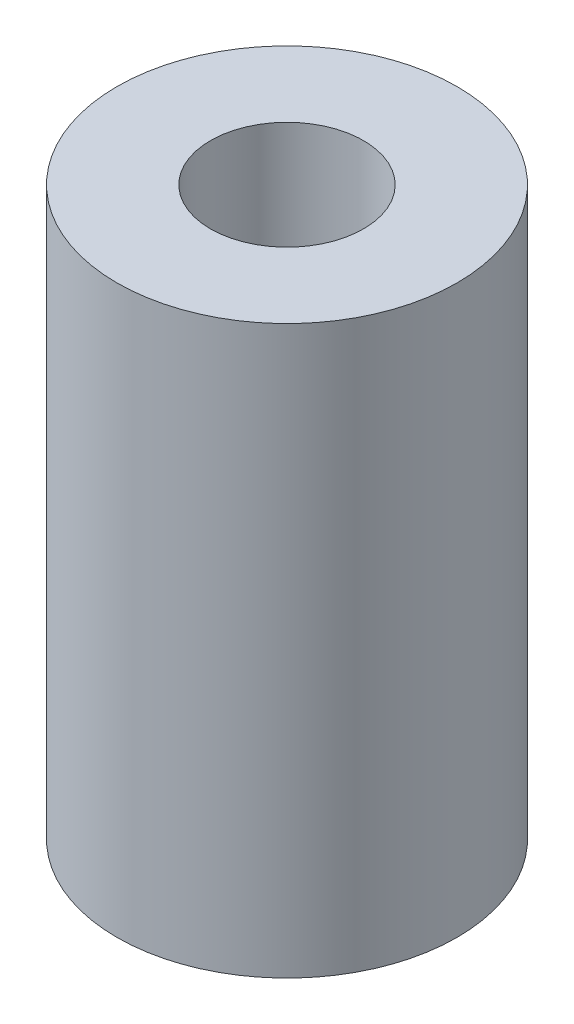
ISO-10303-21;
HEADER;
FILE_DESCRIPTION(('STEP AP214'),'2;1');
FILE_NAME('part.step','',(''),(''),'','','');
FILE_SCHEMA(('AUTOMOTIVE_DESIGN { 1 0 10303 214 1 1 1 1 }'));
ENDSEC;
DATA;
#1=APPLICATION_CONTEXT('core data for automotive mechanical design processes');
#2=APPLICATION_PROTOCOL_DEFINITION('international standard','automotive_design',2000,#1);
#3=PRODUCT_CONTEXT('',#1,'mechanical');
#4=PRODUCT('Part','Part','',(#3));
#5=PRODUCT_RELATED_PRODUCT_CATEGORY('part','',(#4));
#6=PRODUCT_DEFINITION_FORMATION('','',#4);
#7=PRODUCT_DEFINITION_CONTEXT('part definition',#1,'design');
#8=PRODUCT_DEFINITION('design','',#6,#7);
#9=PRODUCT_DEFINITION_SHAPE('','',#8);
#10=(LENGTH_UNIT() NAMED_UNIT(*) SI_UNIT(.MILLI.,.METRE.));
#11=(NAMED_UNIT(*) PLANE_ANGLE_UNIT() SI_UNIT($,.RADIAN.));
#12=(NAMED_UNIT(*) SI_UNIT($,.STERADIAN.) SOLID_ANGLE_UNIT());
#13=UNCERTAINTY_MEASURE_WITH_UNIT(LENGTH_MEASURE(1.E-05),#10,'distance_accuracy_value','');
#14=(GEOMETRIC_REPRESENTATION_CONTEXT(3) GLOBAL_UNCERTAINTY_ASSIGNED_CONTEXT((#13)) GLOBAL_UNIT_ASSIGNED_CONTEXT((#10,
#11,#12)) REPRESENTATION_CONTEXT('',''));
#15=CARTESIAN_POINT('',(0.,0.,0.));
#16=DIRECTION('',(0.,0.,1.));
#17=DIRECTION('',(1.,0.,0.));
#18=AXIS2_PLACEMENT_3D('',#15,#16,#17);
#19=CARTESIAN_POINT('',(0.,10.,0.));
#20=DIRECTION('',(0.,1.,0.));
#21=DIRECTION('',(0.,0.,1.));
#22=AXIS2_PLACEMENT_3D('',#19,#20,#21);
#23=PLANE('',#22);
#24=CARTESIAN_POINT('',(0.,10.,0.));
#25=DIRECTION('',(0.,1.,0.));
#26=DIRECTION('',(0.,0.,1.));
#27=AXIS2_PLACEMENT_3D('',#24,#25,#26);
#28=CIRCLE('',#27,3.);
#29=CARTESIAN_POINT('',(0.,10.,3.));
#30=VERTEX_POINT('',#29);
#31=EDGE_CURVE('E10',#30,#30,#28,.T.);
#32=ORIENTED_EDGE('',*,*,#31,.T.);
#33=EDGE_LOOP('',(#32));
#34=FACE_BOUND('',#33,.T.);
#35=CARTESIAN_POINT('',(0.,10.,0.));
#36=DIRECTION('',(0.,1.,0.));
#37=DIRECTION('',(0.,0.,1.));
#38=AXIS2_PLACEMENT_3D('',#35,#36,#37);
#39=CIRCLE('',#38,1.35);
#40=CARTESIAN_POINT('',(0.,10.,1.35));
#41=VERTEX_POINT('',#40);
#42=EDGE_CURVE('E49',#41,#41,#39,.T.);
#43=ORIENTED_EDGE('',*,*,#42,.F.);
#44=EDGE_LOOP('',(#43));
#45=FACE_BOUND('',#44,.T.);
#46=ADVANCED_FACE('F35',(#34,#45),#23,.T.);
#47=CARTESIAN_POINT('',(0.,0.,0.));
#48=DIRECTION('',(0.,1.,0.));
#49=DIRECTION('',(0.,0.,1.));
#50=AXIS2_PLACEMENT_3D('',#47,#48,#49);
#51=PLANE('',#50);
#52=CARTESIAN_POINT('',(0.,0.,0.));
#53=DIRECTION('',(0.,1.,0.));
#54=DIRECTION('',(0.,0.,1.));
#55=AXIS2_PLACEMENT_3D('',#52,#53,#54);
#56=CIRCLE('',#55,3.);
#57=CARTESIAN_POINT('',(0.,0.,3.));
#58=VERTEX_POINT('',#57);
#59=EDGE_CURVE('E39',#58,#58,#56,.T.);
#60=ORIENTED_EDGE('',*,*,#59,.F.);
#61=EDGE_LOOP('',(#60));
#62=FACE_BOUND('',#61,.T.);
#63=CARTESIAN_POINT('',(0.,0.,0.));
#64=DIRECTION('',(0.,1.,0.));
#65=DIRECTION('',(0.,0.,1.));
#66=AXIS2_PLACEMENT_3D('',#63,#64,#65);
#67=CIRCLE('',#66,1.35);
#68=CARTESIAN_POINT('',(0.,0.,1.35));
#69=VERTEX_POINT('',#68);
#70=EDGE_CURVE('E51',#69,#69,#67,.T.);
#71=ORIENTED_EDGE('',*,*,#70,.T.);
#72=EDGE_LOOP('',(#71));
#73=FACE_BOUND('',#72,.T.);
#74=ADVANCED_FACE('F62',(#62,#73),#51,.F.);
#75=CARTESIAN_POINT('',(0.,10.,0.));
#76=DIRECTION('',(0.,-1.,0.));
#77=DIRECTION('',(0.,0.,-1.));
#78=AXIS2_PLACEMENT_3D('',#75,#76,#77);
#79=CYLINDRICAL_SURFACE('',#78,3.);
#80=ORIENTED_EDGE('',*,*,#31,.F.);
#81=EDGE_LOOP('',(#80));
#82=FACE_BOUND('',#81,.T.);
#83=ORIENTED_EDGE('',*,*,#59,.T.);
#84=EDGE_LOOP('',(#83));
#85=FACE_BOUND('',#84,.T.);
#86=ADVANCED_FACE('F37',(#82,#85),#79,.T.);
#87=CARTESIAN_POINT('',(0.,10.,0.));
#88=DIRECTION('',(0.,-1.,0.));
#89=DIRECTION('',(0.,0.,-1.));
#90=AXIS2_PLACEMENT_3D('',#87,#88,#89);
#91=CYLINDRICAL_SURFACE('',#90,1.35);
#92=ORIENTED_EDGE('',*,*,#42,.T.);
#93=EDGE_LOOP('',(#92));
#94=FACE_BOUND('',#93,.T.);
#95=ORIENTED_EDGE('',*,*,#70,.F.);
#96=EDGE_LOOP('',(#95));
#97=FACE_BOUND('',#96,.T.);
#98=ADVANCED_FACE('F58',(#94,#97),#91,.F.);
#99=CLOSED_SHELL('',(#46,#74,#86,#98));
#100=MANIFOLD_SOLID_BREP('B2',#99);
#101=ADVANCED_BREP_SHAPE_REPRESENTATION('',(#18,#100),#14);
#102=SHAPE_DEFINITION_REPRESENTATION(#9,#101);
ENDSEC;
END-ISO-10303-21;
